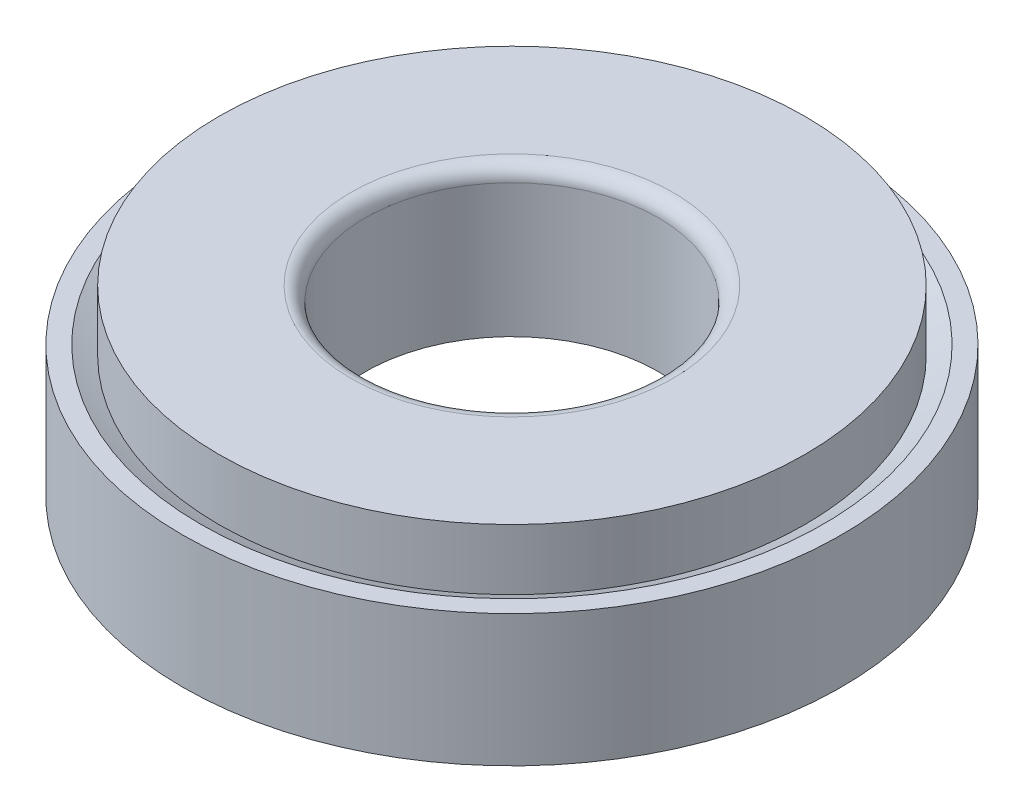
ISO-10303-21;
HEADER;
FILE_DESCRIPTION(('STEP AP214'),'2;1');
FILE_NAME('part.step','',(''),(''),'','','');
FILE_SCHEMA(('AUTOMOTIVE_DESIGN { 1 0 10303 214 1 1 1 1 }'));
ENDSEC;
DATA;
#1=APPLICATION_CONTEXT('core data for automotive mechanical design processes');
#2=APPLICATION_PROTOCOL_DEFINITION('international standard','automotive_design',2000,#1);
#3=PRODUCT_CONTEXT('',#1,'mechanical');
#4=PRODUCT('Part','Part','',(#3));
#5=PRODUCT_RELATED_PRODUCT_CATEGORY('part','',(#4));
#6=PRODUCT_DEFINITION_FORMATION('','',#4);
#7=PRODUCT_DEFINITION_CONTEXT('part definition',#1,'design');
#8=PRODUCT_DEFINITION('design','',#6,#7);
#9=PRODUCT_DEFINITION_SHAPE('','',#8);
#10=(LENGTH_UNIT() NAMED_UNIT(*) SI_UNIT(.MILLI.,.METRE.));
#11=(NAMED_UNIT(*) PLANE_ANGLE_UNIT() SI_UNIT($,.RADIAN.));
#12=(NAMED_UNIT(*) SI_UNIT($,.STERADIAN.) SOLID_ANGLE_UNIT());
#13=UNCERTAINTY_MEASURE_WITH_UNIT(LENGTH_MEASURE(1.E-05),#10,'distance_accuracy_value','');
#14=(GEOMETRIC_REPRESENTATION_CONTEXT(3) GLOBAL_UNCERTAINTY_ASSIGNED_CONTEXT((#13)) GLOBAL_UNIT_ASSIGNED_CONTEXT((#10,
#11,#12)) REPRESENTATION_CONTEXT('',''));
#15=CARTESIAN_POINT('',(0.,0.,0.));
#16=DIRECTION('',(0.,0.,1.));
#17=DIRECTION('',(1.,0.,0.));
#18=AXIS2_PLACEMENT_3D('',#15,#16,#17);
#19=CARTESIAN_POINT('',(0.,12.5,0.));
#20=DIRECTION('',(0.,-1.,0.));
#21=DIRECTION('',(0.,0.,-1.));
#22=AXIS2_PLACEMENT_3D('',#19,#20,#21);
#23=CYLINDRICAL_SURFACE('',#22,20.);
#24=CARTESIAN_POINT('',(0.,8.34799722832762,0.));
#25=DIRECTION('',(0.,1.,0.));
#26=DIRECTION('',(0.,0.,1.));
#27=AXIS2_PLACEMENT_3D('',#24,#25,#26);
#28=CIRCLE('',#27,20.);
#29=CARTESIAN_POINT('',(0.,8.34799722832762,20.));
#30=VERTEX_POINT('',#29);
#31=EDGE_CURVE('P0_E29',#30,#30,#28,.T.);
#32=ORIENTED_EDGE('',*,*,#31,.T.);
#33=EDGE_LOOP('',(#32));
#34=FACE_BOUND('',#33,.T.);
#35=CARTESIAN_POINT('',(0.,12.5,0.));
#36=DIRECTION('',(0.,1.,0.));
#37=DIRECTION('',(0.,0.,1.));
#38=AXIS2_PLACEMENT_3D('',#35,#36,#37);
#39=CIRCLE('',#38,20.);
#40=CARTESIAN_POINT('',(0.,12.5,20.));
#41=VERTEX_POINT('',#40);
#42=EDGE_CURVE('P0_E25',#41,#41,#39,.T.);
#43=ORIENTED_EDGE('',*,*,#42,.F.);
#44=EDGE_LOOP('',(#43));
#45=FACE_BOUND('',#44,.T.);
#46=ADVANCED_FACE('P0_F14',(#34,#45),#23,.T.);
#47=CARTESIAN_POINT('',(0.,12.5,0.));
#48=DIRECTION('',(0.,1.,0.));
#49=DIRECTION('',(0.,0.,1.));
#50=AXIS2_PLACEMENT_3D('',#47,#48,#49);
#51=PLANE('',#50);
#52=CARTESIAN_POINT('',(0.,12.5,0.));
#53=DIRECTION('',(0.,1.,0.));
#54=DIRECTION('',(0.,0.,1.));
#55=AXIS2_PLACEMENT_3D('',#52,#53,#54);
#56=CIRCLE('',#55,11.);
#57=CARTESIAN_POINT('',(0.,12.5,11.));
#58=VERTEX_POINT('',#57);
#59=EDGE_CURVE('P0_E21',#58,#58,#56,.F.);
#60=ORIENTED_EDGE('',*,*,#59,.T.);
#61=EDGE_LOOP('',(#60));
#62=FACE_BOUND('',#61,.T.);
#63=ORIENTED_EDGE('',*,*,#42,.T.);
#64=EDGE_LOOP('',(#63));
#65=FACE_BOUND('',#64,.T.);
#66=ADVANCED_FACE('P0_F92',(#62,#65),#51,.T.);
#67=CARTESIAN_POINT('',(0.,48.2156249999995,0.));
#68=DIRECTION('',(-1.,0.,0.));
#69=DIRECTION('',(0.,-1.,0.));
#70=AXIS2_PLACEMENT_3D('',#67,#68,#69);
#71=SPHERICAL_SURFACE('',#70,44.6030015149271);
#72=CARTESIAN_POINT('',(0.,48.2156249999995,0.));
#73=DIRECTION('',(0.,1.,0.));
#74=DIRECTION('',(0.,0.,1.));
#75=AXIS2_PLACEMENT_3D('',#72,#73,#74);
#76=SPHERICAL_SURFACE('',#75,44.6030015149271);
#77=CARTESIAN_POINT('',(0.,5.4,0.));
#78=DIRECTION('',(0.,1.,0.));
#79=DIRECTION('',(0.,0.,1.));
#80=AXIS2_PLACEMENT_3D('',#77,#78,#79);
#81=CIRCLE('',#80,12.5);
#82=CARTESIAN_POINT('',(0.,5.4,12.5));
#83=VERTEX_POINT('',#82);
#84=EDGE_CURVE('P0_E49',#83,#83,#81,.T.);
#85=ORIENTED_EDGE('',*,*,#84,.T.);
#86=EDGE_LOOP('',(#85));
#87=FACE_BOUND('',#86,.T.);
#88=ORIENTED_EDGE('',*,*,#31,.F.);
#89=EDGE_LOOP('',(#88));
#90=FACE_BOUND('',#89,.T.);
#91=ADVANCED_FACE('P0_F53',(#87,#90),#76,.T.);
#92=CARTESIAN_POINT('',(0.,2.4,0.));
#93=DIRECTION('',(0.,1.,0.));
#94=DIRECTION('',(0.,0.,1.));
#95=AXIS2_PLACEMENT_3D('',#92,#93,#94);
#96=CYLINDRICAL_SURFACE('',#95,12.5);
#97=CARTESIAN_POINT('',(0.,3.9,0.));
#98=DIRECTION('',(0.,1.,0.));
#99=DIRECTION('',(0.,0.,1.));
#100=AXIS2_PLACEMENT_3D('',#97,#98,#99);
#101=CIRCLE('',#100,12.5);
#102=CARTESIAN_POINT('',(0.,3.9,12.5));
#103=VERTEX_POINT('',#102);
#104=EDGE_CURVE('P0_E40',#103,#103,#101,.T.);
#105=ORIENTED_EDGE('',*,*,#104,.F.);
#106=EDGE_LOOP('',(#105));
#107=FACE_BOUND('',#106,.T.);
#108=CARTESIAN_POINT('',(0.,2.4,0.));
#109=DIRECTION('',(0.,1.,0.));
#110=DIRECTION('',(0.,0.,1.));
#111=AXIS2_PLACEMENT_3D('',#108,#109,#110);
#112=CIRCLE('',#111,12.5);
#113=CARTESIAN_POINT('',(0.,2.4,12.5));
#114=VERTEX_POINT('',#113);
#115=EDGE_CURVE('P0_E33',#114,#114,#112,.T.);
#116=ORIENTED_EDGE('',*,*,#115,.T.);
#117=EDGE_LOOP('',(#116));
#118=FACE_BOUND('',#117,.T.);
#119=ADVANCED_FACE('P0_F75',(#107,#118),#96,.T.);
#120=CARTESIAN_POINT('',(0.,2.4,0.));
#121=DIRECTION('',(0.,1.,0.));
#122=DIRECTION('',(0.,0.,1.));
#123=AXIS2_PLACEMENT_3D('',#120,#121,#122);
#124=PLANE('',#123);
#125=CARTESIAN_POINT('',(0.,2.4,0.));
#126=DIRECTION('',(0.,-1.,0.));
#127=DIRECTION('',(0.,0.,-1.));
#128=AXIS2_PLACEMENT_3D('',#125,#126,#127);
#129=CIRCLE('',#128,10.);
#130=CARTESIAN_POINT('',(0.,2.4,-10.));
#131=VERTEX_POINT('',#130);
#132=EDGE_CURVE('P0_E37',#131,#131,#129,.T.);
#133=ORIENTED_EDGE('',*,*,#132,.F.);
#134=EDGE_LOOP('',(#133));
#135=FACE_BOUND('',#134,.T.);
#136=ORIENTED_EDGE('',*,*,#115,.F.);
#137=EDGE_LOOP('',(#136));
#138=FACE_BOUND('',#137,.T.);
#139=ADVANCED_FACE('P0_F78',(#135,#138),#124,.F.);
#140=CARTESIAN_POINT('',(0.,12.5,0.));
#141=DIRECTION('',(0.,-1.,0.));
#142=DIRECTION('',(0.,0.,-1.));
#143=AXIS2_PLACEMENT_3D('',#140,#141,#142);
#144=CYLINDRICAL_SURFACE('',#143,10.);
#145=CARTESIAN_POINT('',(0.,11.5,0.));
#146=DIRECTION('',(0.,1.,0.));
#147=DIRECTION('',(0.,0.,1.));
#148=AXIS2_PLACEMENT_3D('',#145,#146,#147);
#149=CIRCLE('',#148,10.);
#150=CARTESIAN_POINT('',(0.,11.5,10.));
#151=VERTEX_POINT('',#150);
#152=EDGE_CURVE('P0_E10',#151,#151,#149,.T.);
#153=ORIENTED_EDGE('',*,*,#152,.T.);
#154=EDGE_LOOP('',(#153));
#155=FACE_BOUND('',#154,.T.);
#156=ORIENTED_EDGE('',*,*,#132,.T.);
#157=EDGE_LOOP('',(#156));
#158=FACE_BOUND('',#157,.T.);
#159=ADVANCED_FACE('P0_F71',(#155,#158),#144,.F.);
#160=CARTESIAN_POINT('',(-12.5,3.9,0.));
#161=DIRECTION('',(0.,-1.,0.));
#162=DIRECTION('',(0.,0.,-1.));
#163=AXIS2_PLACEMENT_3D('',#160,#161,#162);
#164=PLANE('',#163);
#165=CARTESIAN_POINT('',(0.,3.9,0.));
#166=DIRECTION('',(0.,1.,0.));
#167=DIRECTION('',(0.,0.,1.));
#168=AXIS2_PLACEMENT_3D('',#165,#166,#167);
#169=CIRCLE('',#168,11.25);
#170=CARTESIAN_POINT('',(0.,3.9,11.25));
#171=VERTEX_POINT('',#170);
#172=EDGE_CURVE('P0_E43',#171,#171,#169,.T.);
#173=ORIENTED_EDGE('',*,*,#172,.F.);
#174=EDGE_LOOP('',(#173));
#175=FACE_BOUND('',#174,.T.);
#176=ORIENTED_EDGE('',*,*,#104,.T.);
#177=EDGE_LOOP('',(#176));
#178=FACE_BOUND('',#177,.T.);
#179=ADVANCED_FACE('P0_F65',(#175,#178),#164,.F.);
#180=CARTESIAN_POINT('',(0.,12.5,0.));
#181=DIRECTION('',(0.,1.,0.));
#182=DIRECTION('',(0.,0.,1.));
#183=AXIS2_PLACEMENT_3D('',#180,#181,#182);
#184=CYLINDRICAL_SURFACE('',#183,11.25);
#185=CARTESIAN_POINT('',(0.,5.4,0.));
#186=DIRECTION('',(0.,1.,0.));
#187=DIRECTION('',(0.,0.,1.));
#188=AXIS2_PLACEMENT_3D('',#185,#186,#187);
#189=CIRCLE('',#188,11.25);
#190=CARTESIAN_POINT('',(0.,5.4,11.25));
#191=VERTEX_POINT('',#190);
#192=EDGE_CURVE('P0_E46',#191,#191,#189,.T.);
#193=ORIENTED_EDGE('',*,*,#192,.F.);
#194=EDGE_LOOP('',(#193));
#195=FACE_BOUND('',#194,.T.);
#196=ORIENTED_EDGE('',*,*,#172,.T.);
#197=EDGE_LOOP('',(#196));
#198=FACE_BOUND('',#197,.T.);
#199=ADVANCED_FACE('P0_F59',(#195,#198),#184,.T.);
#200=CARTESIAN_POINT('',(-12.5,5.4,0.));
#201=DIRECTION('',(0.,1.,0.));
#202=DIRECTION('',(0.,0.,1.));
#203=AXIS2_PLACEMENT_3D('',#200,#201,#202);
#204=PLANE('',#203);
#205=ORIENTED_EDGE('',*,*,#84,.F.);
#206=EDGE_LOOP('',(#205));
#207=FACE_BOUND('',#206,.T.);
#208=ORIENTED_EDGE('',*,*,#192,.T.);
#209=EDGE_LOOP('',(#208));
#210=FACE_BOUND('',#209,.T.);
#211=ADVANCED_FACE('P0_F56',(#207,#210),#204,.F.);
#212=CARTESIAN_POINT('',(0.,11.5,0.));
#213=DIRECTION('',(0.,1.,0.));
#214=DIRECTION('',(0.,0.,1.));
#215=AXIS2_PLACEMENT_3D('',#212,#213,#214);
#216=TOROIDAL_SURFACE('',#215,11.,1.);
#217=ORIENTED_EDGE('',*,*,#152,.F.);
#218=EDGE_LOOP('',(#217));
#219=FACE_BOUND('',#218,.T.);
#220=ORIENTED_EDGE('',*,*,#59,.F.);
#221=EDGE_LOOP('',(#220));
#222=FACE_BOUND('',#221,.T.);
#223=ADVANCED_FACE('P0_F16',(#219,#222),#216,.T.);
#224=CLOSED_SHELL('',(#46,#66,#91,#119,#139,#159,#179,#199,#211,#223));
#225=MANIFOLD_SOLID_BREP('P0_B1',#224);
#226=CARTESIAN_POINT('',(0.,9.,0.));
#227=DIRECTION('',(0.,-1.,0.));
#228=DIRECTION('',(0.,0.,-1.));
#229=AXIS2_PLACEMENT_3D('',#226,#227,#228);
#230=CYLINDRICAL_SURFACE('',#229,22.5);
#231=CARTESIAN_POINT('',(0.,9.,0.));
#232=DIRECTION('',(0.,1.,0.));
#233=DIRECTION('',(0.,0.,1.));
#234=AXIS2_PLACEMENT_3D('',#231,#232,#233);
#235=CIRCLE('',#234,22.5);
#236=CARTESIAN_POINT('',(0.,9.,22.5));
#237=VERTEX_POINT('',#236);
#238=EDGE_CURVE('P1_E9',#237,#237,#235,.T.);
#239=ORIENTED_EDGE('',*,*,#238,.F.);
#240=EDGE_LOOP('',(#239));
#241=FACE_BOUND('',#240,.T.);
#242=CARTESIAN_POINT('',(0.,0.,0.));
#243=DIRECTION('',(0.,1.,0.));
#244=DIRECTION('',(0.,0.,1.));
#245=AXIS2_PLACEMENT_3D('',#242,#243,#244);
#246=CIRCLE('',#245,22.5);
#247=CARTESIAN_POINT('',(0.,0.,22.5));
#248=VERTEX_POINT('',#247);
#249=EDGE_CURVE('P1_E20',#248,#248,#246,.T.);
#250=ORIENTED_EDGE('',*,*,#249,.T.);
#251=EDGE_LOOP('',(#250));
#252=FACE_BOUND('',#251,.T.);
#253=ADVANCED_FACE('P1_F13',(#241,#252),#230,.T.);
#254=CARTESIAN_POINT('',(0.,9.,0.));
#255=DIRECTION('',(0.,1.,0.));
#256=DIRECTION('',(0.,0.,1.));
#257=AXIS2_PLACEMENT_3D('',#254,#255,#256);
#258=PLANE('',#257);
#259=CARTESIAN_POINT('',(0.,9.,0.));
#260=DIRECTION('',(0.,1.,0.));
#261=DIRECTION('',(0.,0.,1.));
#262=AXIS2_PLACEMENT_3D('',#259,#260,#261);
#263=CIRCLE('',#262,21.25);
#264=CARTESIAN_POINT('',(0.,9.,21.25));
#265=VERTEX_POINT('',#264);
#266=EDGE_CURVE('P1_E35',#265,#265,#263,.T.);
#267=ORIENTED_EDGE('',*,*,#266,.F.);
#268=EDGE_LOOP('',(#267));
#269=FACE_BOUND('',#268,.T.);
#270=ORIENTED_EDGE('',*,*,#238,.T.);
#271=EDGE_LOOP('',(#270));
#272=FACE_BOUND('',#271,.T.);
#273=ADVANCED_FACE('P1_F55',(#269,#272),#258,.T.);
#274=CARTESIAN_POINT('',(0.,0.,0.));
#275=DIRECTION('',(0.,1.,0.));
#276=DIRECTION('',(0.,0.,1.));
#277=AXIS2_PLACEMENT_3D('',#274,#275,#276);
#278=PLANE('',#277);
#279=CARTESIAN_POINT('',(0.,0.,0.));
#280=DIRECTION('',(0.,-1.,0.));
#281=DIRECTION('',(0.,0.,-1.));
#282=AXIS2_PLACEMENT_3D('',#279,#280,#281);
#283=CIRCLE('',#282,15.);
#284=CARTESIAN_POINT('',(0.,0.,-15.));
#285=VERTEX_POINT('',#284);
#286=EDGE_CURVE('P1_E27',#285,#285,#283,.T.);
#287=ORIENTED_EDGE('',*,*,#286,.F.);
#288=EDGE_LOOP('',(#287));
#289=FACE_BOUND('',#288,.T.);
#290=ORIENTED_EDGE('',*,*,#249,.F.);
#291=EDGE_LOOP('',(#290));
#292=FACE_BOUND('',#291,.T.);
#293=ADVANCED_FACE('P1_F60',(#289,#292),#278,.F.);
#294=CARTESIAN_POINT('',(0.,4.5,0.));
#295=DIRECTION('',(0.,-1.,0.));
#296=DIRECTION('',(0.,0.,-1.));
#297=AXIS2_PLACEMENT_3D('',#294,#295,#296);
#298=CYLINDRICAL_SURFACE('',#297,15.);
#299=CARTESIAN_POINT('',(0.,4.5,0.));
#300=DIRECTION('',(0.,-1.,0.));
#301=DIRECTION('',(0.,0.,-1.));
#302=AXIS2_PLACEMENT_3D('',#299,#300,#301);
#303=CIRCLE('',#302,15.);
#304=CARTESIAN_POINT('',(0.,4.5,-15.));
#305=VERTEX_POINT('',#304);
#306=EDGE_CURVE('P1_E25',#305,#305,#303,.T.);
#307=ORIENTED_EDGE('',*,*,#306,.F.);
#308=EDGE_LOOP('',(#307));
#309=FACE_BOUND('',#308,.T.);
#310=ORIENTED_EDGE('',*,*,#286,.T.);
#311=EDGE_LOOP('',(#310));
#312=FACE_BOUND('',#311,.T.);
#313=ADVANCED_FACE('P1_F67',(#309,#312),#298,.F.);
#314=CARTESIAN_POINT('',(0.,4.5,0.));
#315=DIRECTION('',(0.,-1.,0.));
#316=DIRECTION('',(0.,0.,-1.));
#317=AXIS2_PLACEMENT_3D('',#314,#315,#316);
#318=PLANE('',#317);
#319=CARTESIAN_POINT('',(0.,4.5,0.));
#320=DIRECTION('',(0.,-1.,0.));
#321=DIRECTION('',(0.,0.,-1.));
#322=AXIS2_PLACEMENT_3D('',#319,#320,#321);
#323=CIRCLE('',#322,12.5);
#324=CARTESIAN_POINT('',(0.,4.5,-12.5));
#325=VERTEX_POINT('',#324);
#326=EDGE_CURVE('P1_E30',#325,#325,#323,.T.);
#327=ORIENTED_EDGE('',*,*,#326,.F.);
#328=EDGE_LOOP('',(#327));
#329=FACE_BOUND('',#328,.T.);
#330=ORIENTED_EDGE('',*,*,#306,.T.);
#331=EDGE_LOOP('',(#330));
#332=FACE_BOUND('',#331,.T.);
#333=ADVANCED_FACE('P1_F52',(#329,#332),#318,.T.);
#334=CARTESIAN_POINT('',(0.,9.,0.));
#335=DIRECTION('',(0.,-1.,0.));
#336=DIRECTION('',(0.,0.,-1.));
#337=AXIS2_PLACEMENT_3D('',#334,#335,#336);
#338=CYLINDRICAL_SURFACE('',#337,12.5);
#339=CARTESIAN_POINT('',(0.,5.4,0.));
#340=DIRECTION('',(0.,1.,0.));
#341=DIRECTION('',(0.,0.,1.));
#342=AXIS2_PLACEMENT_3D('',#339,#340,#341);
#343=CIRCLE('',#342,12.5);
#344=CARTESIAN_POINT('',(0.,5.4,12.5));
#345=VERTEX_POINT('',#344);
#346=EDGE_CURVE('P1_E16',#345,#345,#343,.T.);
#347=ORIENTED_EDGE('',*,*,#346,.T.);
#348=EDGE_LOOP('',(#347));
#349=FACE_BOUND('',#348,.T.);
#350=ORIENTED_EDGE('',*,*,#326,.T.);
#351=EDGE_LOOP('',(#350));
#352=FACE_BOUND('',#351,.T.);
#353=ADVANCED_FACE('P1_F42',(#349,#352),#338,.F.);
#354=CARTESIAN_POINT('',(0.,48.215625,0.));
#355=DIRECTION('',(-1.,0.,0.));
#356=DIRECTION('',(0.,1.,0.));
#357=AXIS2_PLACEMENT_3D('',#354,#355,#356);
#358=SPHERICAL_SURFACE('',#357,44.6030015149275);
#359=CARTESIAN_POINT('',(0.,48.215625,0.));
#360=DIRECTION('',(0.,1.,0.));
#361=DIRECTION('',(0.,0.,1.));
#362=AXIS2_PLACEMENT_3D('',#359,#360,#361);
#363=SPHERICAL_SURFACE('',#362,44.6030015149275);
#364=ORIENTED_EDGE('',*,*,#266,.T.);
#365=EDGE_LOOP('',(#364));
#366=FACE_BOUND('',#365,.T.);
#367=ORIENTED_EDGE('',*,*,#346,.F.);
#368=EDGE_LOOP('',(#367));
#369=FACE_BOUND('',#368,.T.);
#370=ADVANCED_FACE('P1_F45',(#366,#369),#363,.F.);
#371=CLOSED_SHELL('',(#253,#273,#293,#313,#333,#353,#370));
#372=MANIFOLD_SOLID_BREP('P1_B1',#371);
#373=ADVANCED_BREP_SHAPE_REPRESENTATION('',(#18,#225,#372),#14);
#374=SHAPE_DEFINITION_REPRESENTATION(#9,#373);
ENDSEC;
END-ISO-10303-21;
